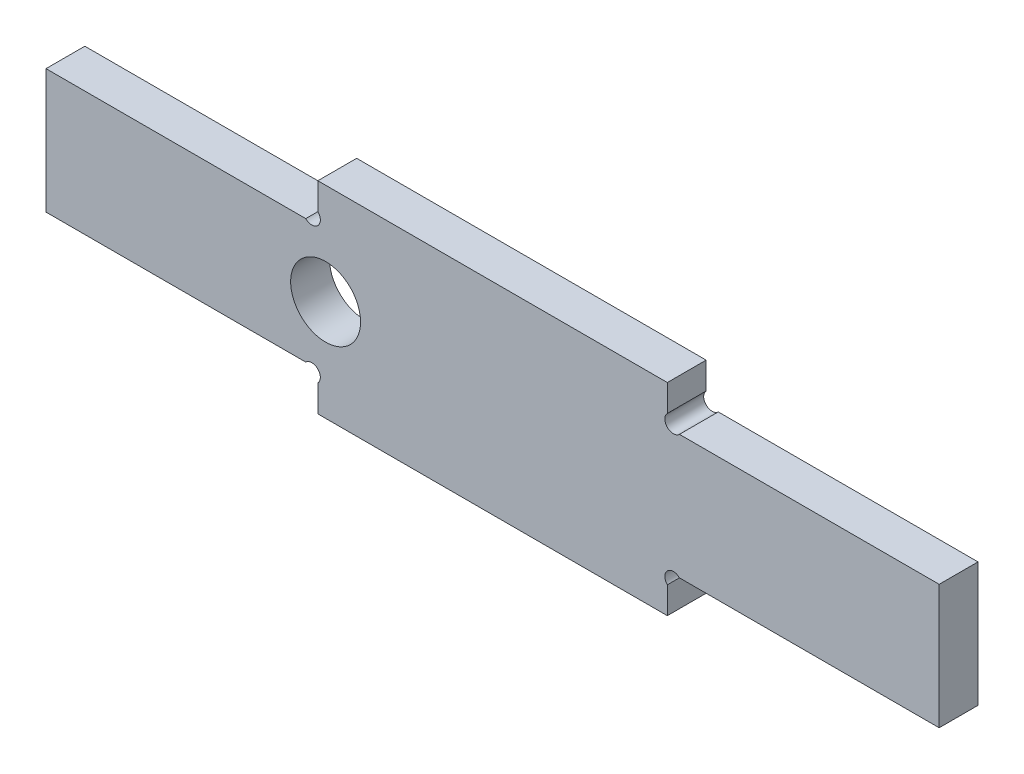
from build123d import *

# Parameters (mm, degrees)
ESQUISSE1_W             = 57.5
ESQUISSE1_H             = 26
BOSS_EXTRU_1_DEPTH      = 5
ENL_V_MAT_EXTRU_1_REACH = 65.303
ESQUISSE3_W             = 35
ESQUISSE3_H             = 5
ENL_V_START             = -5
ESQUISSE5_R             = 1.1
ENL_V_MAT_EXTRU_3_DEPTH = 5
ENL_V_MAT_EXTRU_2_REACH = 120.008
ESQUISSE4_R             = 4.5


with BuildPart() as part:
    # Esquisse1 → Boss.-Extru.1 (new body)
    with BuildSketch(Plane.XY):
        with Locations((28.75, 13)):
            Rectangle(ESQUISSE1_W, ESQUISSE1_H)
    boss_extru_1 = extrude(amount=BOSS_EXTRU_1_DEPTH)

    # Esquisse3 → Enl_v. mat.-Extru.1 (cut, up to next)
    with BuildSketch(Plane.XY.offset(5), mode=Mode.PRIVATE) as enl_v_mat_extru_1_sk1:
        with Locations((17.5, 23.5)):
            Rectangle(ESQUISSE3_W, ESQUISSE3_H)
    enl_v_mat_extru_1_tool1 = extrude(enl_v_mat_extru_1_sk1.sketch, amount=-ENL_V_MAT_EXTRU_1_REACH, mode=Mode.PRIVATE) & part.part
    # Esquisse3 → Enl_v. mat.-Extru.1 (cut, up to next)
    with BuildSketch(Plane.XY.offset(5), mode=Mode.PRIVATE) as enl_v_mat_extru_1_sk2:
        with Locations((17.5, 2.5)):
            Rectangle(ESQUISSE3_W, ESQUISSE3_H)
    enl_v_mat_extru_1_tool2 = extrude(enl_v_mat_extru_1_sk2.sketch, amount=-ENL_V_MAT_EXTRU_1_REACH, mode=Mode.PRIVATE) & part.part
    enl_v_mat_extru_1_1 = enl_v_mat_extru_1_tool1.solids().sort_by_distance((17.5, 23.5, 5))[0]
    add(enl_v_mat_extru_1_1, mode=Mode.SUBTRACT)
    enl_v_mat_extru_1_2 = enl_v_mat_extru_1_tool2.solids().sort_by_distance((17.5, 2.5, 5))[0]
    add(enl_v_mat_extru_1_2, mode=Mode.SUBTRACT)
    enl_v_mat_extru_1 = enl_v_mat_extru_1_1 + enl_v_mat_extru_1_2  # Enl_v. mat.-Extru.1 as one shape, for the pattern or mirror that repeats it

    # Esquisse5 → Enl_v. mat.-Extru.3 (cut)
    with BuildSketch(Plane.XY.offset(5).offset(ENL_V_START)):
        with Locations((34.222182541, 21.777817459)):
            Circle(ESQUISSE5_R)
        with Locations((34.222182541, 4.222182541)):
            Circle(ESQUISSE5_R)
    enl_v_mat_extru_3 = extrude(amount=ENL_V_MAT_EXTRU_3_DEPTH, mode=Mode.SUBTRACT)

    # Sym_trie1: Boss.-Extru.1, Enl_v. mat.-Extru.1, Enl_v. mat.-Extru.3 across plane
    add(boss_extru_1.mirror(Plane(origin=(57.5, 0, 5), x_dir=(0, 0, 1), z_dir=(-1, 0, 0))))
    add(enl_v_mat_extru_1.mirror(Plane(origin=(57.5, 0, 5), x_dir=(0, 0, 1), z_dir=(-1, 0, 0))), mode=Mode.SUBTRACT)
    add(enl_v_mat_extru_3.mirror(Plane(origin=(57.5, 0, 5), x_dir=(0, 0, 1), z_dir=(-1, 0, 0))), mode=Mode.SUBTRACT)

    # Esquisse4 → Enl_v. mat.-Extru.2 (cut, up to next)
    with BuildSketch(Plane.XY.offset(5), mode=Mode.PRIVATE) as enl_v_mat_extru_2_sk1:
        with Locations((36, 13)):
            Circle(ESQUISSE4_R)
    enl_v_mat_extru_2_tool1 = extrude(enl_v_mat_extru_2_sk1.sketch, amount=-ENL_V_MAT_EXTRU_2_REACH, mode=Mode.PRIVATE) & part.part
    add(enl_v_mat_extru_2_tool1.solids().sort_by_distance((36, 13, 5))[0], mode=Mode.SUBTRACT)


solid = part.part
